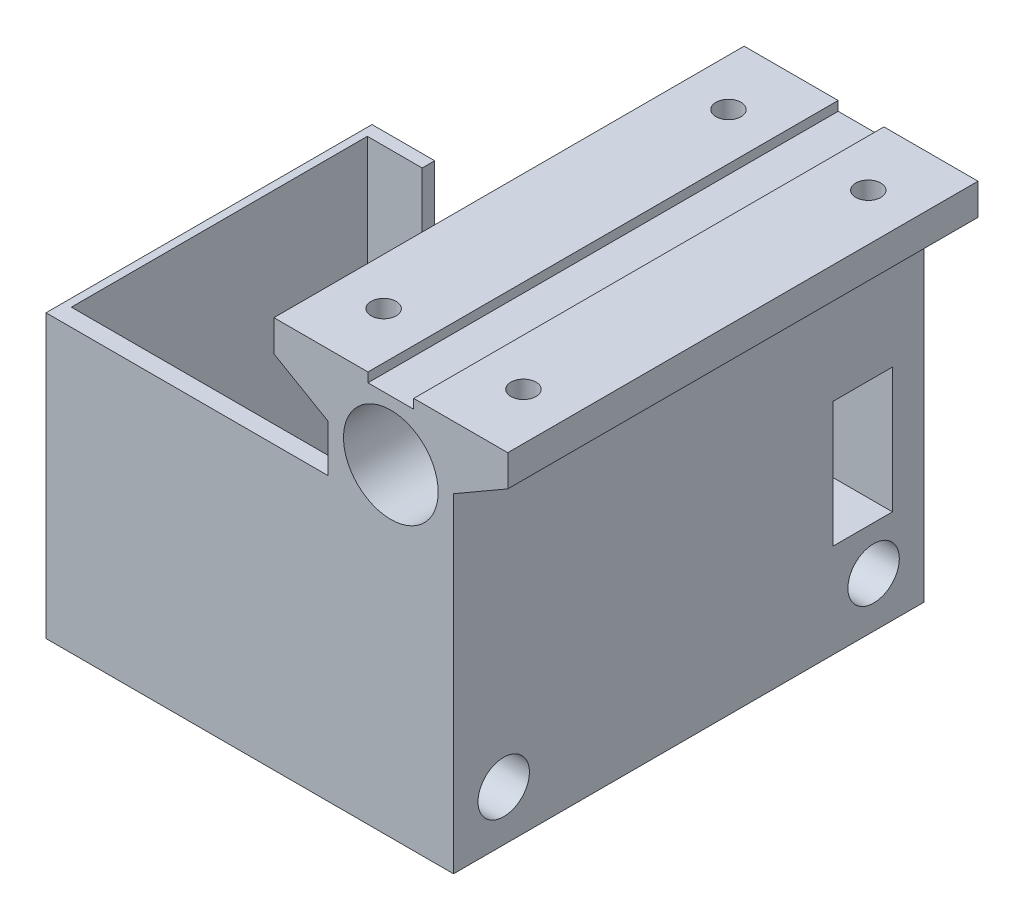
from build123d import *

# Parameters (mm, degrees)
CROQUIS1_R              = 7.55
SALIENTE_EXTRUIR1_DEPTH = 75
CROQUIS2_R              = 4.1
CORTAR_EXTRUIR1_DEPTH   = 10
CROQUIS3_W              = 52
CROQUIS3_H              = 45
SALIENTE_EXTRUIR2_DEPTH = 45
CORTAR_EXTRUIR3_DEPTH   = 42
CROQUIS5_W              = 9.5
CROQUIS5_H              = 20
CORTAR_EXTRUIR4_DEPTH   = 102.5
CROQUIS6_R              = 2
CORTAR_EXTRUIR5_DEPTH   = 5


with BuildPart() as part:
    # Croquis1 → Saliente-Extruir1 (new body)
    with BuildSketch(Plane.XY):
        Polygon((-3.65, 11), (-3.65, 9.5), (3.65, 9.5), (3.65, 11), (18.65, 11), (18.65, 6), (10, 1.005920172), (10, -51.5), (-10, -51.5), (-10, 1.005920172), (-18.65, 6), (-18.65, 11), align=None)
        Circle(CROQUIS1_R, mode=Mode.SUBTRACT)
    extrude(amount=SALIENTE_EXTRUIR1_DEPTH)

    # Croquis2 → Cortar-Extruir1 (cut)
    with BuildSketch(Plane(origin=(10, 0, 0), x_dir=(0, 0, -1), z_dir=(1, 0, 0))):
        with Locations(Location((-8, -43.5, 0), (0, 0, 90))):
            Circle(CROQUIS2_R)
        with Locations(Location((-67, -43.5, 0), (0, 0, 90))):
            Circle(CROQUIS2_R)
    extrude(amount=-CORTAR_EXTRUIR1_DEPTH, mode=Mode.SUBTRACT)

    # Croquis3 → Saliente-Extruir2 (add)
    with BuildSketch(Plane.ZY.offset(10)):
        with Locations((49, -29)):
            Rectangle(CROQUIS3_W, CROQUIS3_H)
    extrude(amount=SALIENTE_EXTRUIR2_DEPTH)

    # Croquis4 → Cortar-Extruir3 (cut)
    with BuildSketch(Plane(origin=(0, -6.5, 0), x_dir=(1, 0, 0), z_dir=(0, 1, 0))):
        Polygon((-53.75, -25), (-45, -25), (-45, -23), (-20, -23), (-20, -25), (-11.25, -25), (-11.25, -72.2), (-53.75, -72.2), align=None)
    extrude(amount=-CORTAR_EXTRUIR3_DEPTH, mode=Mode.SUBTRACT)

    # Croquis5 → Cortar-Extruir4 (cut, through all)
    with BuildSketch(Plane.ZY.offset(10)):
        with Locations((9.75, -26.5)):
            Rectangle(CROQUIS5_W, CROQUIS5_H)
    extrude(amount=-CORTAR_EXTRUIR4_DEPTH, mode=Mode.SUBTRACT)

    # Croquis6 → Cortar-Extruir5 (cut)
    with BuildSketch(Plane(origin=(0, 11, 0), x_dir=(1, 0, 0), z_dir=(0, 1, 0))):
        with Locations(Location((11.15, -10, 0), (0, 0, 180))):
            Circle(CROQUIS6_R)
        with Locations(Location((-11.15, -10, 0), (0, 0, 180))):
            Circle(CROQUIS6_R)
        with Locations(Location((-11.15, -65, 0), (0, 0, 180))):
            Circle(CROQUIS6_R)
        with Locations(Location((11.15, -65, 0), (0, 0, 180))):
            Circle(CROQUIS6_R)
    extrude(amount=-CORTAR_EXTRUIR5_DEPTH, mode=Mode.SUBTRACT)


solid = part.part
